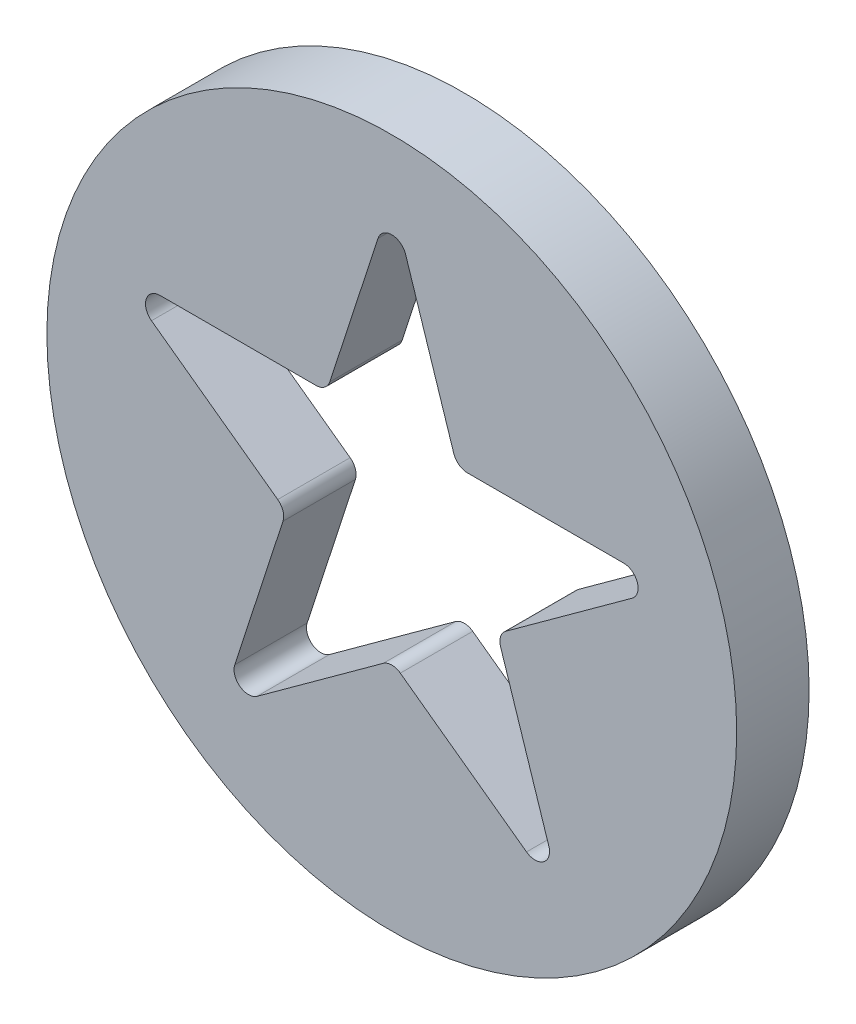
from build123d import *

# Parameters (mm, degrees)
SKETCH1_R           = 9.525
BOSS_EXTRUDE1_DEPTH = 2
FILLET1_R           = 0.4
FILLET2_R           = 0.4


with BuildPart() as part:
    # Sketch1 → Boss-Extrude1 (new body)
    # profile 1 of 6: a face of its own
    with BuildSketch(Plane.XY):
        Circle(SKETCH1_R)
        Polygon((7.632228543, 2.47986138), (0, 8.025), (-7.632228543, 2.47986138), (-4.71697665, -6.49236138), (4.71697665, -6.49236138), align=None, mode=Mode.SUBTRACT)
    # profile 2 of 6: a face of its own
    with BuildSketch(Plane.XY):
        Polygon((-2.915251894, -0.94722276), (-7.632228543, 2.47986138), (-4.71697665, -6.49236138), align=None)
    # profile 3 of 6: a face of its own
    with BuildSketch(Plane.XY):
        Polygon((-1.801724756, 2.47986138), (0, 8.025), (-7.632228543, 2.47986138), align=None)
    # profile 4 of 6: a face of its own
    with BuildSketch(Plane.XY):
        Polygon((7.632228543, 2.47986138), (0, 8.025), (1.801724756, 2.47986138), align=None)
    # profile 5 of 6: a face of its own
    with BuildSketch(Plane.XY):
        Polygon((4.71697665, -6.49236138), (7.632228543, 2.47986138), (2.915251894, -0.94722276), align=None)
    # profile 6 of 6: a face of its own
    with BuildSketch(Plane.XY):
        Polygon((0, -3.06527724), (-4.71697665, -6.49236138), (4.71697665, -6.49236138), align=None)
    extrude(amount=BOSS_EXTRUDE1_DEPTH)

    # Fillet1
    fillet1_edges = [part.edges().sort_by_distance(p)[0] for p in [
        (-7.632228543, 2.47986138, 1),
        (-4.71697665, -6.49236138, 1),
        (4.71697665, -6.49236138, 1),
        (7.632228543, 2.47986138, 1),
        (0, 8.025, 1),
    ]]
    fillet(fillet1_edges, radius=FILLET1_R)

    # Fillet2
    fillet2_edges = [part.edges().sort_by_distance(p)[0] for p in [
        (-1.801724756, 2.47986138, 1),
        (-2.915251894, -0.94722276, 1),
        (0, -3.06527724, 1),
        (2.915251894, -0.94722276, 1),
        (1.801724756, 2.47986138, 1),
    ]]
    fillet(fillet2_edges, radius=FILLET2_R)


solid = part.part
